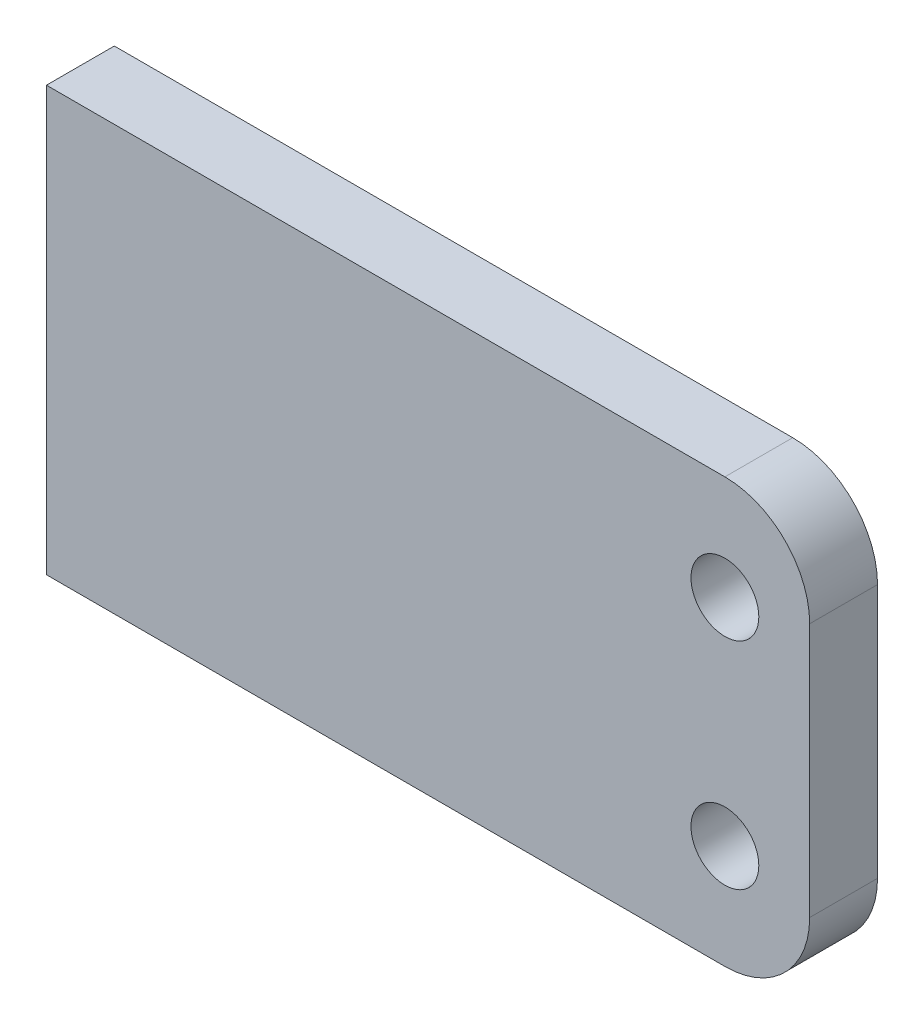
from build123d import *

# Parameters (mm, degrees)
ESQUISSE1_R          = 4
BASE_EXTRUSION_DEPTH = 8


with BuildPart() as part:
    # Esquisse1 → Base-Extrusion (new body)
    with BuildSketch(Plane.XY):
        with BuildLine():
            Line((0, 0), (80, 0))
            ThreePointArc((80, 0), (87.071067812, -2.928932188), (90, -10))
            Line((90, -10), (90, -40))
            ThreePointArc((90, -40), (87.071067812, -47.071067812), (80, -50))
            Line((80, -50), (0, -50))
            Line((0, -50), (0, 0))
        make_face()
        with Locations((80, -12.3)):
            Circle(ESQUISSE1_R, mode=Mode.SUBTRACT)
        with Locations((80, -37.7)):
            Circle(ESQUISSE1_R, mode=Mode.SUBTRACT)
    extrude(amount=BASE_EXTRUSION_DEPTH)


solid = part.part
